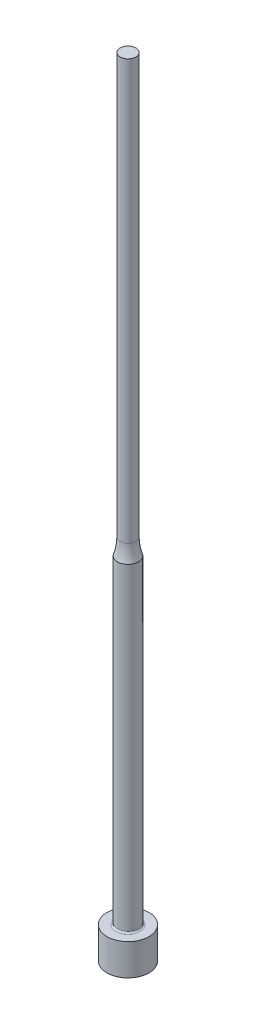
ISO-10303-21;
HEADER;
FILE_DESCRIPTION(('STEP AP214'),'2;1');
FILE_NAME('part.step','',(''),(''),'','','');
FILE_SCHEMA(('AUTOMOTIVE_DESIGN { 1 0 10303 214 1 1 1 1 }'));
ENDSEC;
DATA;
#1=APPLICATION_CONTEXT('core data for automotive mechanical design processes');
#2=APPLICATION_PROTOCOL_DEFINITION('international standard','automotive_design',2000,#1);
#3=PRODUCT_CONTEXT('',#1,'mechanical');
#4=PRODUCT('Part','Part','',(#3));
#5=PRODUCT_RELATED_PRODUCT_CATEGORY('part','',(#4));
#6=PRODUCT_DEFINITION_FORMATION('','',#4);
#7=PRODUCT_DEFINITION_CONTEXT('part definition',#1,'design');
#8=PRODUCT_DEFINITION('design','',#6,#7);
#9=PRODUCT_DEFINITION_SHAPE('','',#8);
#10=(LENGTH_UNIT() NAMED_UNIT(*) SI_UNIT(.MILLI.,.METRE.));
#11=(NAMED_UNIT(*) PLANE_ANGLE_UNIT() SI_UNIT($,.RADIAN.));
#12=(NAMED_UNIT(*) SI_UNIT($,.STERADIAN.) SOLID_ANGLE_UNIT());
#13=UNCERTAINTY_MEASURE_WITH_UNIT(LENGTH_MEASURE(1.E-05),#10,'distance_accuracy_value','');
#14=(GEOMETRIC_REPRESENTATION_CONTEXT(3) GLOBAL_UNCERTAINTY_ASSIGNED_CONTEXT((#13)) GLOBAL_UNIT_ASSIGNED_CONTEXT((#10,
#11,#12)) REPRESENTATION_CONTEXT('',''));
#15=CARTESIAN_POINT('',(0.,0.,0.));
#16=DIRECTION('',(0.,0.,1.));
#17=DIRECTION('',(1.,0.,0.));
#18=AXIS2_PLACEMENT_3D('',#15,#16,#17);
#19=CARTESIAN_POINT('',(1.50000000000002,150.,0.));
#20=DIRECTION('',(0.,-1.,0.));
#21=DIRECTION('',(1.,0.,0.));
#22=AXIS2_PLACEMENT_3D('',#19,#20,#21);
#23=PLANE('',#22);
#24=CARTESIAN_POINT('',(0.,150.,0.));
#25=DIRECTION('',(0.,1.,0.));
#26=DIRECTION('',(-1.,0.,0.));
#27=AXIS2_PLACEMENT_3D('',#24,#25,#26);
#28=CIRCLE('',#27,1.50000000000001);
#29=CARTESIAN_POINT('',(-1.5,150.,0.));
#30=VERTEX_POINT('',#29);
#31=EDGE_CURVE('E10',#30,#30,#28,.T.);
#32=ORIENTED_EDGE('',*,*,#31,.T.);
#33=EDGE_LOOP('',(#32));
#34=FACE_BOUND('',#33,.T.);
#35=ADVANCED_FACE('F30',(#34),#23,.F.);
#36=CARTESIAN_POINT('',(0.,150.,0.));
#37=DIRECTION('',(0.,1.,0.));
#38=DIRECTION('',(-1.,0.,0.));
#39=AXIS2_PLACEMENT_3D('',#36,#37,#38);
#40=CYLINDRICAL_SURFACE('',#39,1.50000000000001);
#41=ORIENTED_EDGE('',*,*,#31,.F.);
#42=EDGE_LOOP('',(#41));
#43=FACE_BOUND('',#42,.T.);
#44=CARTESIAN_POINT('',(0.,70.,0.));
#45=DIRECTION('',(0.,1.,0.));
#46=DIRECTION('',(-1.,0.,0.));
#47=AXIS2_PLACEMENT_3D('',#44,#45,#46);
#48=CIRCLE('',#47,1.50000000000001);
#49=CARTESIAN_POINT('',(-1.50000000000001,70.,0.));
#50=VERTEX_POINT('',#49);
#51=EDGE_CURVE('E36',#50,#50,#48,.T.);
#52=ORIENTED_EDGE('',*,*,#51,.T.);
#53=EDGE_LOOP('',(#52));
#54=FACE_BOUND('',#53,.T.);
#55=ADVANCED_FACE('F71',(#43,#54),#40,.T.);
#56=CARTESIAN_POINT('',(0.,70.,0.));
#57=DIRECTION('',(0.,1.,0.));
#58=DIRECTION('',(-1.,0.,0.));
#59=AXIS2_PLACEMENT_3D('',#56,#57,#58);
#60=TOROIDAL_SURFACE('',#59,11.5,10.);
#61=ORIENTED_EDGE('',*,*,#51,.F.);
#62=EDGE_LOOP('',(#61));
#63=FACE_BOUND('',#62,.T.);
#64=CARTESIAN_POINT('',(0.,66.8775010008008,0.));
#65=DIRECTION('',(0.,1.,0.));
#66=DIRECTION('',(-1.,0.,0.));
#67=AXIS2_PLACEMENT_3D('',#64,#65,#66);
#68=CIRCLE('',#67,2.00000000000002);
#69=CARTESIAN_POINT('',(-2.00000000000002,66.8775010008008,0.));
#70=VERTEX_POINT('',#69);
#71=EDGE_CURVE('E40',#70,#70,#68,.T.);
#72=ORIENTED_EDGE('',*,*,#71,.T.);
#73=EDGE_LOOP('',(#72));
#74=FACE_BOUND('',#73,.T.);
#75=ADVANCED_FACE('F75',(#63,#74),#60,.F.);
#76=CARTESIAN_POINT('',(0.,150.,0.));
#77=DIRECTION('',(0.,1.,0.));
#78=DIRECTION('',(-1.,0.,0.));
#79=AXIS2_PLACEMENT_3D('',#76,#77,#78);
#80=CYLINDRICAL_SURFACE('',#79,2.00000000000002);
#81=ORIENTED_EDGE('',*,*,#71,.F.);
#82=EDGE_LOOP('',(#81));
#83=FACE_BOUND('',#82,.T.);
#84=CARTESIAN_POINT('',(0.,6.3,0.));
#85=DIRECTION('',(0.,1.,0.));
#86=DIRECTION('',(-1.,0.,0.));
#87=AXIS2_PLACEMENT_3D('',#84,#85,#86);
#88=CIRCLE('',#87,2.00000000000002);
#89=CARTESIAN_POINT('',(-2.00000000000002,6.3,0.));
#90=VERTEX_POINT('',#89);
#91=EDGE_CURVE('E44',#90,#90,#88,.T.);
#92=ORIENTED_EDGE('',*,*,#91,.T.);
#93=EDGE_LOOP('',(#92));
#94=FACE_BOUND('',#93,.T.);
#95=ADVANCED_FACE('F80',(#83,#94),#80,.T.);
#96=CARTESIAN_POINT('',(0.,6.3,0.));
#97=DIRECTION('',(0.,1.,0.));
#98=DIRECTION('',(-1.,0.,0.));
#99=AXIS2_PLACEMENT_3D('',#96,#97,#98);
#100=TOROIDAL_SURFACE('',#99,2.30000000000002,0.3);
#101=ORIENTED_EDGE('',*,*,#91,.F.);
#102=EDGE_LOOP('',(#101));
#103=FACE_BOUND('',#102,.T.);
#104=CARTESIAN_POINT('',(0.,6.00000000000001,0.));
#105=DIRECTION('',(0.,1.,0.));
#106=DIRECTION('',(-1.,0.,0.));
#107=AXIS2_PLACEMENT_3D('',#104,#105,#106);
#108=CIRCLE('',#107,2.30000000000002);
#109=CARTESIAN_POINT('',(-2.30000000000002,6.00000000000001,0.));
#110=VERTEX_POINT('',#109);
#111=EDGE_CURVE('E49',#110,#110,#108,.T.);
#112=ORIENTED_EDGE('',*,*,#111,.T.);
#113=EDGE_LOOP('',(#112));
#114=FACE_BOUND('',#113,.T.);
#115=ADVANCED_FACE('F86',(#103,#114),#100,.F.);
#116=CARTESIAN_POINT('',(4.00000000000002,6.,0.));
#117=DIRECTION('',(0.,-1.,0.));
#118=DIRECTION('',(1.,0.,0.));
#119=AXIS2_PLACEMENT_3D('',#116,#117,#118);
#120=PLANE('',#119);
#121=ORIENTED_EDGE('',*,*,#111,.F.);
#122=EDGE_LOOP('',(#121));
#123=FACE_BOUND('',#122,.T.);
#124=CARTESIAN_POINT('',(0.,6.00000000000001,0.));
#125=DIRECTION('',(0.,1.,0.));
#126=DIRECTION('',(-1.,0.,0.));
#127=AXIS2_PLACEMENT_3D('',#124,#125,#126);
#128=CIRCLE('',#127,4.00000000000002);
#129=CARTESIAN_POINT('',(-4.00000000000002,6.00000000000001,0.));
#130=VERTEX_POINT('',#129);
#131=EDGE_CURVE('E52',#130,#130,#128,.T.);
#132=ORIENTED_EDGE('',*,*,#131,.T.);
#133=EDGE_LOOP('',(#132));
#134=FACE_BOUND('',#133,.T.);
#135=ADVANCED_FACE('F67',(#123,#134),#120,.F.);
#136=CARTESIAN_POINT('',(0.,150.,0.));
#137=DIRECTION('',(0.,1.,0.));
#138=DIRECTION('',(-1.,0.,0.));
#139=AXIS2_PLACEMENT_3D('',#136,#137,#138);
#140=CYLINDRICAL_SURFACE('',#139,4.00000000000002);
#141=ORIENTED_EDGE('',*,*,#131,.F.);
#142=EDGE_LOOP('',(#141));
#143=FACE_BOUND('',#142,.T.);
#144=CARTESIAN_POINT('',(0.,0.,0.));
#145=DIRECTION('',(0.,1.,0.));
#146=DIRECTION('',(-1.,0.,0.));
#147=AXIS2_PLACEMENT_3D('',#144,#145,#146);
#148=CIRCLE('',#147,4.00000000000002);
#149=CARTESIAN_POINT('',(-4.00000000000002,0.,0.));
#150=VERTEX_POINT('',#149);
#151=EDGE_CURVE('E55',#150,#150,#148,.T.);
#152=ORIENTED_EDGE('',*,*,#151,.T.);
#153=EDGE_LOOP('',(#152));
#154=FACE_BOUND('',#153,.T.);
#155=ADVANCED_FACE('F59',(#143,#154),#140,.T.);
#156=CARTESIAN_POINT('',(0.,0.,0.));
#157=DIRECTION('',(0.,1.,0.));
#158=DIRECTION('',(-1.,0.,0.));
#159=AXIS2_PLACEMENT_3D('',#156,#157,#158);
#160=PLANE('',#159);
#161=ORIENTED_EDGE('',*,*,#151,.F.);
#162=EDGE_LOOP('',(#161));
#163=FACE_BOUND('',#162,.T.);
#164=ADVANCED_FACE('F61',(#163),#160,.F.);
#165=CLOSED_SHELL('',(#35,#55,#75,#95,#115,#135,#155,#164));
#166=MANIFOLD_SOLID_BREP('B2',#165);
#167=ADVANCED_BREP_SHAPE_REPRESENTATION('',(#18,#166),#14);
#168=SHAPE_DEFINITION_REPRESENTATION(#9,#167);
ENDSEC;
END-ISO-10303-21;
